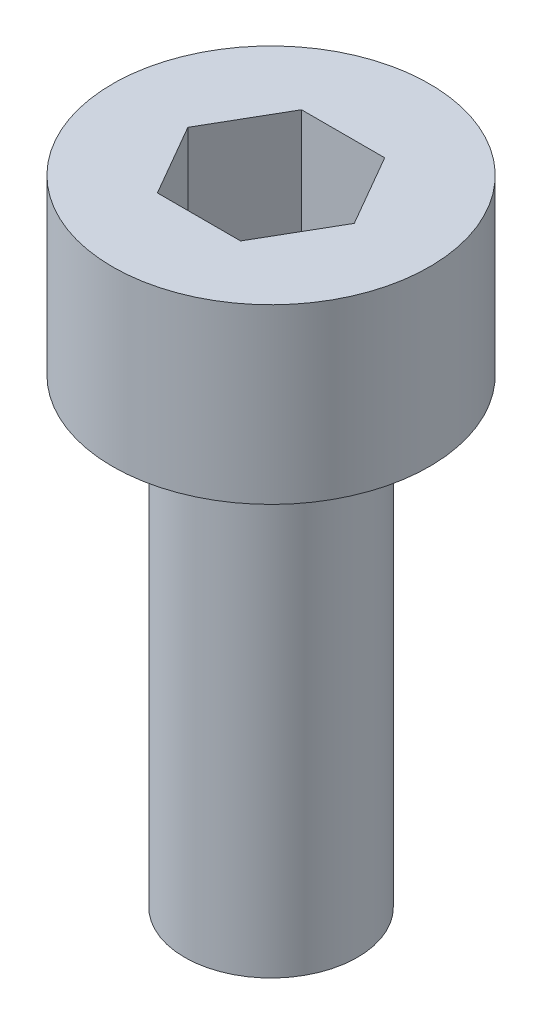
ISO-10303-21;
HEADER;
FILE_DESCRIPTION(('STEP AP214'),'2;1');
FILE_NAME('part.step','',(''),(''),'','','');
FILE_SCHEMA(('AUTOMOTIVE_DESIGN { 1 0 10303 214 1 1 1 1 }'));
ENDSEC;
DATA;
#1=APPLICATION_CONTEXT('core data for automotive mechanical design processes');
#2=APPLICATION_PROTOCOL_DEFINITION('international standard','automotive_design',2000,#1);
#3=PRODUCT_CONTEXT('',#1,'mechanical');
#4=PRODUCT('Part','Part','',(#3));
#5=PRODUCT_RELATED_PRODUCT_CATEGORY('part','',(#4));
#6=PRODUCT_DEFINITION_FORMATION('','',#4);
#7=PRODUCT_DEFINITION_CONTEXT('part definition',#1,'design');
#8=PRODUCT_DEFINITION('design','',#6,#7);
#9=PRODUCT_DEFINITION_SHAPE('','',#8);
#10=(LENGTH_UNIT() NAMED_UNIT(*) SI_UNIT(.MILLI.,.METRE.));
#11=(NAMED_UNIT(*) PLANE_ANGLE_UNIT() SI_UNIT($,.RADIAN.));
#12=(NAMED_UNIT(*) SI_UNIT($,.STERADIAN.) SOLID_ANGLE_UNIT());
#13=UNCERTAINTY_MEASURE_WITH_UNIT(LENGTH_MEASURE(1.E-05),#10,'distance_accuracy_value','');
#14=(GEOMETRIC_REPRESENTATION_CONTEXT(3) GLOBAL_UNCERTAINTY_ASSIGNED_CONTEXT((#13)) GLOBAL_UNIT_ASSIGNED_CONTEXT((#10,
#11,#12)) REPRESENTATION_CONTEXT('',''));
#15=CARTESIAN_POINT('',(0.,0.,0.));
#16=DIRECTION('',(0.,0.,1.));
#17=DIRECTION('',(1.,0.,0.));
#18=AXIS2_PLACEMENT_3D('',#15,#16,#17);
#19=CARTESIAN_POINT('',(1.5,-8.,0.));
#20=DIRECTION('',(0.,1.,0.));
#21=DIRECTION('',(0.,0.,1.));
#22=AXIS2_PLACEMENT_3D('',#19,#20,#21);
#23=PLANE('',#22);
#24=CARTESIAN_POINT('',(0.,-8.,0.));
#25=DIRECTION('',(0.,1.,0.));
#26=DIRECTION('',(0.,0.,1.));
#27=AXIS2_PLACEMENT_3D('',#24,#25,#26);
#28=CIRCLE('',#27,1.5);
#29=CARTESIAN_POINT('',(0.,-8.,1.5));
#30=VERTEX_POINT('',#29);
#31=EDGE_CURVE('E11',#30,#30,#28,.T.);
#32=ORIENTED_EDGE('',*,*,#31,.F.);
#33=EDGE_LOOP('',(#32));
#34=FACE_BOUND('',#33,.T.);
#35=ADVANCED_FACE('F34',(#34),#23,.F.);
#36=CARTESIAN_POINT('',(0.,9.90721096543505,0.));
#37=DIRECTION('',(0.,1.,0.));
#38=DIRECTION('',(0.,0.,1.));
#39=AXIS2_PLACEMENT_3D('',#36,#37,#38);
#40=CYLINDRICAL_SURFACE('',#39,1.5);
#41=CARTESIAN_POINT('',(0.,0.,0.));
#42=DIRECTION('',(0.,1.,0.));
#43=DIRECTION('',(0.,0.,1.));
#44=AXIS2_PLACEMENT_3D('',#41,#42,#43);
#45=CIRCLE('',#44,1.5);
#46=CARTESIAN_POINT('',(0.,0.,1.5));
#47=VERTEX_POINT('',#46);
#48=EDGE_CURVE('E41',#47,#47,#45,.T.);
#49=ORIENTED_EDGE('',*,*,#48,.F.);
#50=EDGE_LOOP('',(#49));
#51=FACE_BOUND('',#50,.T.);
#52=ORIENTED_EDGE('',*,*,#31,.T.);
#53=EDGE_LOOP('',(#52));
#54=FACE_BOUND('',#53,.T.);
#55=ADVANCED_FACE('F150',(#51,#54),#40,.T.);
#56=CARTESIAN_POINT('',(2.75,0.,0.));
#57=DIRECTION('',(0.,1.,0.));
#58=DIRECTION('',(0.,0.,1.));
#59=AXIS2_PLACEMENT_3D('',#56,#57,#58);
#60=PLANE('',#59);
#61=CARTESIAN_POINT('',(0.,0.,0.));
#62=DIRECTION('',(0.,1.,0.));
#63=DIRECTION('',(0.,0.,1.));
#64=AXIS2_PLACEMENT_3D('',#61,#62,#63);
#65=CIRCLE('',#64,2.75);
#66=CARTESIAN_POINT('',(0.,0.,2.75));
#67=VERTEX_POINT('',#66);
#68=EDGE_CURVE('E143',#67,#67,#65,.T.);
#69=ORIENTED_EDGE('',*,*,#68,.F.);
#70=EDGE_LOOP('',(#69));
#71=FACE_BOUND('',#70,.T.);
#72=ORIENTED_EDGE('',*,*,#48,.T.);
#73=EDGE_LOOP('',(#72));
#74=FACE_BOUND('',#73,.T.);
#75=ADVANCED_FACE('F148',(#71,#74),#60,.F.);
#76=CARTESIAN_POINT('',(0.,9.90721096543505,0.));
#77=DIRECTION('',(0.,1.,0.));
#78=DIRECTION('',(0.,0.,1.));
#79=AXIS2_PLACEMENT_3D('',#76,#77,#78);
#80=CYLINDRICAL_SURFACE('',#79,2.75);
#81=CARTESIAN_POINT('',(0.,3.,0.));
#82=DIRECTION('',(0.,1.,0.));
#83=DIRECTION('',(0.,0.,1.));
#84=AXIS2_PLACEMENT_3D('',#81,#82,#83);
#85=CIRCLE('',#84,2.75);
#86=CARTESIAN_POINT('',(0.,3.,2.75));
#87=VERTEX_POINT('',#86);
#88=EDGE_CURVE('E135',#87,#87,#85,.T.);
#89=ORIENTED_EDGE('',*,*,#88,.F.);
#90=EDGE_LOOP('',(#89));
#91=FACE_BOUND('',#90,.T.);
#92=ORIENTED_EDGE('',*,*,#68,.T.);
#93=EDGE_LOOP('',(#92));
#94=FACE_BOUND('',#93,.T.);
#95=ADVANCED_FACE('F168',(#91,#94),#80,.T.);
#96=CARTESIAN_POINT('',(0.,3.,0.));
#97=DIRECTION('',(0.,-1.,0.));
#98=DIRECTION('',(0.,0.,-1.));
#99=AXIS2_PLACEMENT_3D('',#96,#97,#98);
#100=PLANE('',#99);
#101=DIRECTION('',(-0.500000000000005,0.,-0.866025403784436));
#102=VECTOR('',#101,1.);
#103=CARTESIAN_POINT('',(1.44337567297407,3.,0.));
#104=LINE('',#103,#102);
#105=CARTESIAN_POINT('',(1.44337567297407,3.,0.));
#106=VERTEX_POINT('',#105);
#107=CARTESIAN_POINT('',(0.721687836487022,3.,-1.25));
#108=VERTEX_POINT('',#107);
#109=EDGE_CURVE('E122',#106,#108,#104,.T.);
#110=ORIENTED_EDGE('',*,*,#109,.F.);
#111=DIRECTION('',(0.499999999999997,0.,-0.866025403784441));
#112=VECTOR('',#111,1.);
#113=CARTESIAN_POINT('',(0.721687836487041,3.,1.25));
#114=LINE('',#113,#112);
#115=CARTESIAN_POINT('',(0.721687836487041,3.,1.25));
#116=VERTEX_POINT('',#115);
#117=EDGE_CURVE('E48',#116,#106,#114,.T.);
#118=ORIENTED_EDGE('',*,*,#117,.F.);
#119=DIRECTION('',(1.,0.,0.));
#120=VECTOR('',#119,1.);
#121=CARTESIAN_POINT('',(-0.721687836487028,3.,1.25));
#122=LINE('',#121,#120);
#123=CARTESIAN_POINT('',(-0.721687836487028,3.,1.25));
#124=VERTEX_POINT('',#123);
#125=EDGE_CURVE('E131',#124,#116,#122,.T.);
#126=ORIENTED_EDGE('',*,*,#125,.F.);
#127=DIRECTION('',(0.500000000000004,0.,0.866025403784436));
#128=VECTOR('',#127,1.);
#129=CARTESIAN_POINT('',(-1.44337567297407,3.,0.));
#130=LINE('',#129,#128);
#131=CARTESIAN_POINT('',(-1.44337567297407,3.,0.));
#132=VERTEX_POINT('',#131);
#133=EDGE_CURVE('E129',#132,#124,#130,.T.);
#134=ORIENTED_EDGE('',*,*,#133,.F.);
#135=DIRECTION('',(-0.499999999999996,0.,0.866025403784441));
#136=VECTOR('',#135,1.);
#137=CARTESIAN_POINT('',(-0.721687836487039,3.,-1.25));
#138=LINE('',#137,#136);
#139=CARTESIAN_POINT('',(-0.721687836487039,3.,-1.25));
#140=VERTEX_POINT('',#139);
#141=EDGE_CURVE('E96',#140,#132,#138,.T.);
#142=ORIENTED_EDGE('',*,*,#141,.F.);
#143=DIRECTION('',(-1.,0.,0.));
#144=VECTOR('',#143,1.);
#145=CARTESIAN_POINT('',(0.721687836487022,3.,-1.25));
#146=LINE('',#145,#144);
#147=EDGE_CURVE('E125',#108,#140,#146,.T.);
#148=ORIENTED_EDGE('',*,*,#147,.F.);
#149=EDGE_LOOP('',(#110,#118,#126,#134,#142,#148));
#150=FACE_BOUND('',#149,.T.);
#151=ORIENTED_EDGE('',*,*,#88,.T.);
#152=EDGE_LOOP('',(#151));
#153=FACE_BOUND('',#152,.T.);
#154=ADVANCED_FACE('F176',(#150,#153),#100,.F.);
#155=CARTESIAN_POINT('',(0.721687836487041,0.5,1.25));
#156=DIRECTION('',(0.86602540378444,0.,0.499999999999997));
#157=DIRECTION('',(0.499999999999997,0.,-0.86602540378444));
#158=AXIS2_PLACEMENT_3D('',#155,#156,#157);
#159=PLANE('',#158);
#160=ORIENTED_EDGE('',*,*,#117,.T.);
#161=DIRECTION('',(0.,1.,0.));
#162=VECTOR('',#161,1.);
#163=CARTESIAN_POINT('',(1.44337567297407,0.5,0.));
#164=LINE('',#163,#162);
#165=CARTESIAN_POINT('',(1.44337567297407,0.5,0.));
#166=VERTEX_POINT('',#165);
#167=EDGE_CURVE('E78',#166,#106,#164,.T.);
#168=ORIENTED_EDGE('',*,*,#167,.F.);
#169=DIRECTION('',(0.499999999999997,0.,-0.866025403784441));
#170=VECTOR('',#169,1.);
#171=CARTESIAN_POINT('',(0.721687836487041,0.5,1.25));
#172=LINE('',#171,#170);
#173=CARTESIAN_POINT('',(0.721687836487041,0.5,1.25));
#174=VERTEX_POINT('',#173);
#175=EDGE_CURVE('E133',#174,#166,#172,.T.);
#176=ORIENTED_EDGE('',*,*,#175,.F.);
#177=DIRECTION('',(0.,1.,0.));
#178=VECTOR('',#177,1.);
#179=CARTESIAN_POINT('',(0.721687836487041,0.5,1.25));
#180=LINE('',#179,#178);
#181=EDGE_CURVE('E56',#174,#116,#180,.T.);
#182=ORIENTED_EDGE('',*,*,#181,.T.);
#183=EDGE_LOOP('',(#160,#168,#176,#182));
#184=FACE_BOUND('',#183,.T.);
#185=ADVANCED_FACE('F184',(#184),#159,.F.);
#186=CARTESIAN_POINT('',(-0.721687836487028,0.5,1.25));
#187=DIRECTION('',(0.,0.,1.));
#188=DIRECTION('',(1.,0.,0.));
#189=AXIS2_PLACEMENT_3D('',#186,#187,#188);
#190=PLANE('',#189);
#191=ORIENTED_EDGE('',*,*,#125,.T.);
#192=ORIENTED_EDGE('',*,*,#181,.F.);
#193=DIRECTION('',(1.,0.,0.));
#194=VECTOR('',#193,1.);
#195=CARTESIAN_POINT('',(-0.721687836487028,0.5,1.25));
#196=LINE('',#195,#194);
#197=CARTESIAN_POINT('',(-0.721687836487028,0.5,1.25));
#198=VERTEX_POINT('',#197);
#199=EDGE_CURVE('E108',#198,#174,#196,.T.);
#200=ORIENTED_EDGE('',*,*,#199,.F.);
#201=DIRECTION('',(0.,1.,0.));
#202=VECTOR('',#201,1.);
#203=CARTESIAN_POINT('',(-0.721687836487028,0.5,1.25));
#204=LINE('',#203,#202);
#205=EDGE_CURVE('E100',#198,#124,#204,.T.);
#206=ORIENTED_EDGE('',*,*,#205,.T.);
#207=EDGE_LOOP('',(#191,#192,#200,#206));
#208=FACE_BOUND('',#207,.T.);
#209=ADVANCED_FACE('F192',(#208),#190,.F.);
#210=CARTESIAN_POINT('',(-1.44337567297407,0.5,0.));
#211=DIRECTION('',(-0.866025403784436,0.,0.500000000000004));
#212=DIRECTION('',(0.500000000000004,0.,0.866025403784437));
#213=AXIS2_PLACEMENT_3D('',#210,#211,#212);
#214=PLANE('',#213);
#215=ORIENTED_EDGE('',*,*,#133,.T.);
#216=ORIENTED_EDGE('',*,*,#205,.F.);
#217=DIRECTION('',(0.500000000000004,0.,0.866025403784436));
#218=VECTOR('',#217,1.);
#219=CARTESIAN_POINT('',(-1.44337567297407,0.5,0.));
#220=LINE('',#219,#218);
#221=CARTESIAN_POINT('',(-1.44337567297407,0.5,0.));
#222=VERTEX_POINT('',#221);
#223=EDGE_CURVE('E104',#222,#198,#220,.T.);
#224=ORIENTED_EDGE('',*,*,#223,.F.);
#225=DIRECTION('',(0.,1.,0.));
#226=VECTOR('',#225,1.);
#227=CARTESIAN_POINT('',(-1.44337567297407,0.5,0.));
#228=LINE('',#227,#226);
#229=EDGE_CURVE('E89',#222,#132,#228,.T.);
#230=ORIENTED_EDGE('',*,*,#229,.T.);
#231=EDGE_LOOP('',(#215,#216,#224,#230));
#232=FACE_BOUND('',#231,.T.);
#233=ADVANCED_FACE('F105',(#232),#214,.F.);
#234=CARTESIAN_POINT('',(-0.721687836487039,0.5,-1.25));
#235=DIRECTION('',(-0.866025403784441,0.,-0.499999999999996));
#236=DIRECTION('',(-0.499999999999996,0.,0.866025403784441));
#237=AXIS2_PLACEMENT_3D('',#234,#235,#236);
#238=PLANE('',#237);
#239=ORIENTED_EDGE('',*,*,#141,.T.);
#240=ORIENTED_EDGE('',*,*,#229,.F.);
#241=DIRECTION('',(-0.499999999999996,0.,0.866025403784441));
#242=VECTOR('',#241,1.);
#243=CARTESIAN_POINT('',(-0.721687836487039,0.5,-1.25));
#244=LINE('',#243,#242);
#245=CARTESIAN_POINT('',(-0.721687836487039,0.5,-1.25));
#246=VERTEX_POINT('',#245);
#247=EDGE_CURVE('E93',#246,#222,#244,.T.);
#248=ORIENTED_EDGE('',*,*,#247,.F.);
#249=DIRECTION('',(0.,1.,0.));
#250=VECTOR('',#249,1.);
#251=CARTESIAN_POINT('',(-0.721687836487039,0.5,-1.25));
#252=LINE('',#251,#250);
#253=EDGE_CURVE('E101',#246,#140,#252,.T.);
#254=ORIENTED_EDGE('',*,*,#253,.T.);
#255=EDGE_LOOP('',(#239,#240,#248,#254));
#256=FACE_BOUND('',#255,.T.);
#257=ADVANCED_FACE('F91',(#256),#238,.F.);
#258=CARTESIAN_POINT('',(0.721687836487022,0.5,-1.25));
#259=DIRECTION('',(0.,0.,-1.));
#260=DIRECTION('',(-1.,0.,0.));
#261=AXIS2_PLACEMENT_3D('',#258,#259,#260);
#262=PLANE('',#261);
#263=ORIENTED_EDGE('',*,*,#147,.T.);
#264=ORIENTED_EDGE('',*,*,#253,.F.);
#265=DIRECTION('',(-1.,0.,0.));
#266=VECTOR('',#265,1.);
#267=CARTESIAN_POINT('',(0.721687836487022,0.5,-1.25));
#268=LINE('',#267,#266);
#269=CARTESIAN_POINT('',(0.721687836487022,0.5,-1.25));
#270=VERTEX_POINT('',#269);
#271=EDGE_CURVE('E114',#270,#246,#268,.T.);
#272=ORIENTED_EDGE('',*,*,#271,.F.);
#273=DIRECTION('',(0.,1.,0.));
#274=VECTOR('',#273,1.);
#275=CARTESIAN_POINT('',(0.721687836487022,0.5,-1.25));
#276=LINE('',#275,#274);
#277=EDGE_CURVE('E138',#270,#108,#276,.T.);
#278=ORIENTED_EDGE('',*,*,#277,.T.);
#279=EDGE_LOOP('',(#263,#264,#272,#278));
#280=FACE_BOUND('',#279,.T.);
#281=ADVANCED_FACE('F211',(#280),#262,.F.);
#282=CARTESIAN_POINT('',(1.44337567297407,0.5,0.));
#283=DIRECTION('',(0.866025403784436,0.,-0.500000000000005));
#284=DIRECTION('',(-0.500000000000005,0.,-0.866025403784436));
#285=AXIS2_PLACEMENT_3D('',#282,#283,#284);
#286=PLANE('',#285);
#287=ORIENTED_EDGE('',*,*,#109,.T.);
#288=ORIENTED_EDGE('',*,*,#277,.F.);
#289=DIRECTION('',(-0.500000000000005,0.,-0.866025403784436));
#290=VECTOR('',#289,1.);
#291=CARTESIAN_POINT('',(1.44337567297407,0.5,0.));
#292=LINE('',#291,#290);
#293=EDGE_CURVE('E116',#166,#270,#292,.T.);
#294=ORIENTED_EDGE('',*,*,#293,.F.);
#295=ORIENTED_EDGE('',*,*,#167,.T.);
#296=EDGE_LOOP('',(#287,#288,#294,#295));
#297=FACE_BOUND('',#296,.T.);
#298=ADVANCED_FACE('F218',(#297),#286,.F.);
#299=CARTESIAN_POINT('',(0.,0.5,0.));
#300=DIRECTION('',(0.,1.,0.));
#301=DIRECTION('',(0.,0.,1.));
#302=AXIS2_PLACEMENT_3D('',#299,#300,#301);
#303=PLANE('',#302);
#304=ORIENTED_EDGE('',*,*,#175,.T.);
#305=ORIENTED_EDGE('',*,*,#293,.T.);
#306=ORIENTED_EDGE('',*,*,#271,.T.);
#307=ORIENTED_EDGE('',*,*,#247,.T.);
#308=ORIENTED_EDGE('',*,*,#223,.T.);
#309=ORIENTED_EDGE('',*,*,#199,.T.);
#310=EDGE_LOOP('',(#304,#305,#306,#307,#308,#309));
#311=FACE_BOUND('',#310,.T.);
#312=ADVANCED_FACE('F111',(#311),#303,.T.);
#313=CLOSED_SHELL('',(#35,#55,#75,#95,#154,#185,#209,#233,#257,#281,#298,#312));
#314=MANIFOLD_SOLID_BREP('B2',#313);
#315=ADVANCED_BREP_SHAPE_REPRESENTATION('',(#18,#314),#14);
#316=SHAPE_DEFINITION_REPRESENTATION(#9,#315);
ENDSEC;
END-ISO-10303-21;
